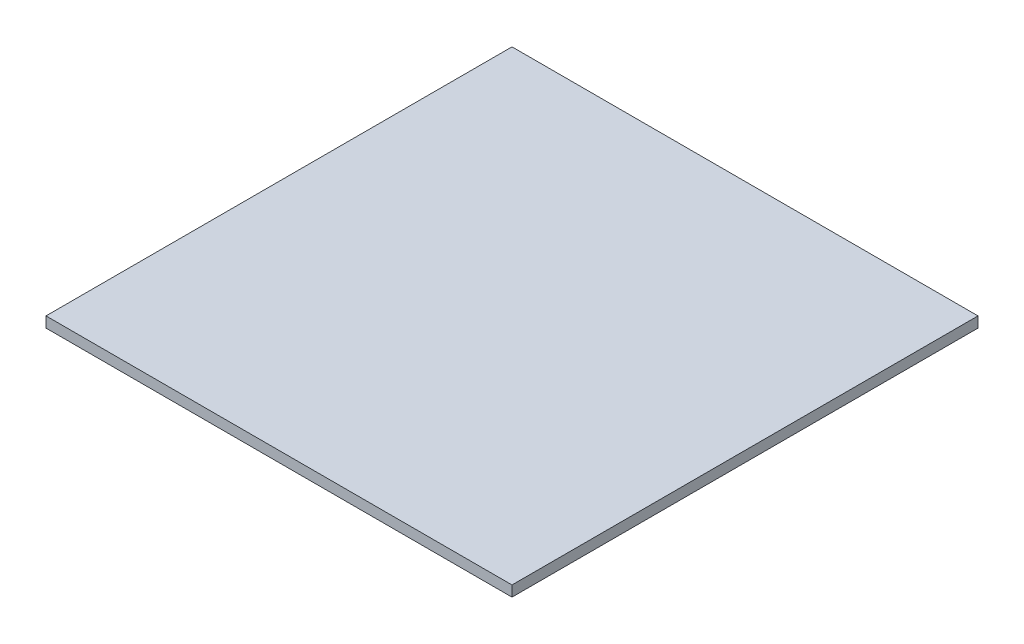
ISO-10303-21;
HEADER;
FILE_DESCRIPTION(('STEP AP214'),'2;1');
FILE_NAME('part.step','',(''),(''),'','','');
FILE_SCHEMA(('AUTOMOTIVE_DESIGN { 1 0 10303 214 1 1 1 1 }'));
ENDSEC;
DATA;
#1=APPLICATION_CONTEXT('core data for automotive mechanical design processes');
#2=APPLICATION_PROTOCOL_DEFINITION('international standard','automotive_design',2000,#1);
#3=PRODUCT_CONTEXT('',#1,'mechanical');
#4=PRODUCT('Part','Part','',(#3));
#5=PRODUCT_RELATED_PRODUCT_CATEGORY('part','',(#4));
#6=PRODUCT_DEFINITION_FORMATION('','',#4);
#7=PRODUCT_DEFINITION_CONTEXT('part definition',#1,'design');
#8=PRODUCT_DEFINITION('design','',#6,#7);
#9=PRODUCT_DEFINITION_SHAPE('','',#8);
#10=(LENGTH_UNIT() NAMED_UNIT(*) SI_UNIT(.MILLI.,.METRE.));
#11=(NAMED_UNIT(*) PLANE_ANGLE_UNIT() SI_UNIT($,.RADIAN.));
#12=(NAMED_UNIT(*) SI_UNIT($,.STERADIAN.) SOLID_ANGLE_UNIT());
#13=UNCERTAINTY_MEASURE_WITH_UNIT(LENGTH_MEASURE(1.E-05),#10,'distance_accuracy_value','');
#14=(GEOMETRIC_REPRESENTATION_CONTEXT(3) GLOBAL_UNCERTAINTY_ASSIGNED_CONTEXT((#13)) GLOBAL_UNIT_ASSIGNED_CONTEXT((#10,
#11,#12)) REPRESENTATION_CONTEXT('',''));
#15=CARTESIAN_POINT('',(0.,0.,0.));
#16=DIRECTION('',(0.,0.,1.));
#17=DIRECTION('',(1.,0.,0.));
#18=AXIS2_PLACEMENT_3D('',#15,#16,#17);
#19=CARTESIAN_POINT('',(0.,1.5875,34.5508223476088));
#20=DIRECTION('',(0.,0.,-1.));
#21=DIRECTION('',(-1.,0.,0.));
#22=AXIS2_PLACEMENT_3D('',#19,#20,#21);
#23=PLANE('',#22);
#24=DIRECTION('',(1.,0.,0.));
#25=VECTOR('',#24,1.);
#26=CARTESIAN_POINT('',(0.,0.,34.5508223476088));
#27=LINE('',#26,#25);
#28=CARTESIAN_POINT('',(-34.8002741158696,0.,34.5508223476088));
#29=VERTEX_POINT('',#28);
#30=CARTESIAN_POINT('',(35.0497258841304,0.,34.5508223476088));
#31=VERTEX_POINT('',#30);
#32=EDGE_CURVE('E102',#29,#31,#27,.T.);
#33=ORIENTED_EDGE('',*,*,#32,.T.);
#34=DIRECTION('',(0.,-1.,0.));
#35=VECTOR('',#34,1.);
#36=CARTESIAN_POINT('',(35.0497258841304,1.5875,34.5508223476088));
#37=LINE('',#36,#35);
#38=CARTESIAN_POINT('',(35.0497258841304,1.5875,34.5508223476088));
#39=VERTEX_POINT('',#38);
#40=EDGE_CURVE('E11',#39,#31,#37,.T.);
#41=ORIENTED_EDGE('',*,*,#40,.F.);
#42=DIRECTION('',(1.,0.,0.));
#43=VECTOR('',#42,1.);
#44=CARTESIAN_POINT('',(0.,1.5875,34.5508223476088));
#45=LINE('',#44,#43);
#46=CARTESIAN_POINT('',(-34.8002741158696,1.5875,34.5508223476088));
#47=VERTEX_POINT('',#46);
#48=EDGE_CURVE('E88',#47,#39,#45,.T.);
#49=ORIENTED_EDGE('',*,*,#48,.F.);
#50=DIRECTION('',(0.,-1.,0.));
#51=VECTOR('',#50,1.);
#52=CARTESIAN_POINT('',(-34.8002741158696,1.5875,34.5508223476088));
#53=LINE('',#52,#51);
#54=EDGE_CURVE('E55',#47,#29,#53,.T.);
#55=ORIENTED_EDGE('',*,*,#54,.T.);
#56=EDGE_LOOP('',(#33,#41,#49,#55));
#57=FACE_BOUND('',#56,.T.);
#58=ADVANCED_FACE('F39',(#57),#23,.F.);
#59=CARTESIAN_POINT('',(35.0497258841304,1.5875,0.));
#60=DIRECTION('',(-1.,0.,0.));
#61=DIRECTION('',(0.,0.,1.));
#62=AXIS2_PLACEMENT_3D('',#59,#60,#61);
#63=PLANE('',#62);
#64=DIRECTION('',(0.,0.,-1.));
#65=VECTOR('',#64,1.);
#66=CARTESIAN_POINT('',(35.0497258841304,0.,0.));
#67=LINE('',#66,#65);
#68=CARTESIAN_POINT('',(35.0497258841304,0.,-35.2991776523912));
#69=VERTEX_POINT('',#68);
#70=EDGE_CURVE('E93',#31,#69,#67,.T.);
#71=ORIENTED_EDGE('',*,*,#70,.T.);
#72=DIRECTION('',(0.,-1.,0.));
#73=VECTOR('',#72,1.);
#74=CARTESIAN_POINT('',(35.0497258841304,1.5875,-35.2991776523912));
#75=LINE('',#74,#73);
#76=CARTESIAN_POINT('',(35.0497258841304,1.5875,-35.2991776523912));
#77=VERTEX_POINT('',#76);
#78=EDGE_CURVE('E47',#77,#69,#75,.T.);
#79=ORIENTED_EDGE('',*,*,#78,.F.);
#80=DIRECTION('',(0.,0.,-1.));
#81=VECTOR('',#80,1.);
#82=CARTESIAN_POINT('',(35.0497258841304,1.5875,0.));
#83=LINE('',#82,#81);
#84=EDGE_CURVE('E80',#39,#77,#83,.T.);
#85=ORIENTED_EDGE('',*,*,#84,.F.);
#86=ORIENTED_EDGE('',*,*,#40,.T.);
#87=EDGE_LOOP('',(#71,#79,#85,#86));
#88=FACE_BOUND('',#87,.T.);
#89=ADVANCED_FACE('F92',(#88),#63,.F.);
#90=CARTESIAN_POINT('',(0.,1.5875,-35.2991776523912));
#91=DIRECTION('',(0.,0.,-1.));
#92=DIRECTION('',(-1.,0.,0.));
#93=AXIS2_PLACEMENT_3D('',#90,#91,#92);
#94=PLANE('',#93);
#95=DIRECTION('',(1.,0.,0.));
#96=VECTOR('',#95,1.);
#97=CARTESIAN_POINT('',(0.,0.,-35.2991776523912));
#98=LINE('',#97,#96);
#99=CARTESIAN_POINT('',(-34.8002741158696,0.,-35.2991776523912));
#100=VERTEX_POINT('',#99);
#101=EDGE_CURVE('E105',#100,#69,#98,.T.);
#102=ORIENTED_EDGE('',*,*,#101,.F.);
#103=DIRECTION('',(0.,-1.,0.));
#104=VECTOR('',#103,1.);
#105=CARTESIAN_POINT('',(-34.8002741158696,1.5875,-35.2991776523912));
#106=LINE('',#105,#104);
#107=CARTESIAN_POINT('',(-34.8002741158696,1.5875,-35.2991776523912));
#108=VERTEX_POINT('',#107);
#109=EDGE_CURVE('E69',#108,#100,#106,.T.);
#110=ORIENTED_EDGE('',*,*,#109,.F.);
#111=DIRECTION('',(1.,0.,0.));
#112=VECTOR('',#111,1.);
#113=CARTESIAN_POINT('',(0.,1.5875,-35.2991776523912));
#114=LINE('',#113,#112);
#115=EDGE_CURVE('E87',#108,#77,#114,.T.);
#116=ORIENTED_EDGE('',*,*,#115,.T.);
#117=ORIENTED_EDGE('',*,*,#78,.T.);
#118=EDGE_LOOP('',(#102,#110,#116,#117));
#119=FACE_BOUND('',#118,.T.);
#120=ADVANCED_FACE('F96',(#119),#94,.T.);
#121=CARTESIAN_POINT('',(-34.8002741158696,1.5875,0.));
#122=DIRECTION('',(-1.,0.,0.));
#123=DIRECTION('',(0.,0.,1.));
#124=AXIS2_PLACEMENT_3D('',#121,#122,#123);
#125=PLANE('',#124);
#126=DIRECTION('',(0.,0.,-1.));
#127=VECTOR('',#126,1.);
#128=CARTESIAN_POINT('',(-34.8002741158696,0.,0.));
#129=LINE('',#128,#127);
#130=EDGE_CURVE('E107',#29,#100,#129,.T.);
#131=ORIENTED_EDGE('',*,*,#130,.F.);
#132=ORIENTED_EDGE('',*,*,#54,.F.);
#133=DIRECTION('',(0.,0.,-1.));
#134=VECTOR('',#133,1.);
#135=CARTESIAN_POINT('',(-34.8002741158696,1.5875,0.));
#136=LINE('',#135,#134);
#137=EDGE_CURVE('E97',#47,#108,#136,.T.);
#138=ORIENTED_EDGE('',*,*,#137,.T.);
#139=ORIENTED_EDGE('',*,*,#109,.T.);
#140=EDGE_LOOP('',(#131,#132,#138,#139));
#141=FACE_BOUND('',#140,.T.);
#142=ADVANCED_FACE('F113',(#141),#125,.T.);
#143=CARTESIAN_POINT('',(0.,1.5875,0.));
#144=DIRECTION('',(0.,1.,0.));
#145=DIRECTION('',(0.,0.,1.));
#146=AXIS2_PLACEMENT_3D('',#143,#144,#145);
#147=PLANE('',#146);
#148=ORIENTED_EDGE('',*,*,#48,.T.);
#149=ORIENTED_EDGE('',*,*,#84,.T.);
#150=ORIENTED_EDGE('',*,*,#115,.F.);
#151=ORIENTED_EDGE('',*,*,#137,.F.);
#152=EDGE_LOOP('',(#148,#149,#150,#151));
#153=FACE_BOUND('',#152,.T.);
#154=ADVANCED_FACE('F84',(#153),#147,.T.);
#155=CARTESIAN_POINT('',(0.,0.,0.));
#156=DIRECTION('',(0.,1.,0.));
#157=DIRECTION('',(0.,0.,1.));
#158=AXIS2_PLACEMENT_3D('',#155,#156,#157);
#159=PLANE('',#158);
#160=ORIENTED_EDGE('',*,*,#32,.F.);
#161=ORIENTED_EDGE('',*,*,#130,.T.);
#162=ORIENTED_EDGE('',*,*,#101,.T.);
#163=ORIENTED_EDGE('',*,*,#70,.F.);
#164=EDGE_LOOP('',(#160,#161,#162,#163));
#165=FACE_BOUND('',#164,.T.);
#166=ADVANCED_FACE('F112',(#165),#159,.F.);
#167=CLOSED_SHELL('',(#58,#89,#120,#142,#154,#166));
#168=MANIFOLD_SOLID_BREP('B2',#167);
#169=ADVANCED_BREP_SHAPE_REPRESENTATION('',(#18,#168),#14);
#170=SHAPE_DEFINITION_REPRESENTATION(#9,#169);
ENDSEC;
END-ISO-10303-21;
